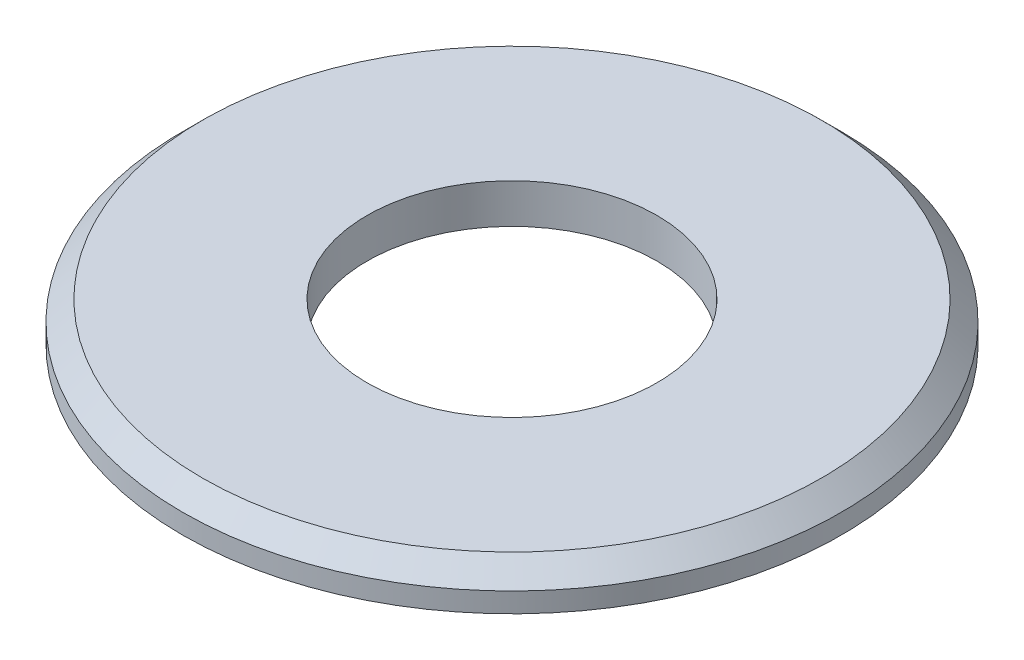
ISO-10303-21;
HEADER;
FILE_DESCRIPTION(('STEP AP214'),'2;1');
FILE_NAME('part.step','',(''),(''),'','','');
FILE_SCHEMA(('AUTOMOTIVE_DESIGN { 1 0 10303 214 1 1 1 1 }'));
ENDSEC;
DATA;
#1=APPLICATION_CONTEXT('core data for automotive mechanical design processes');
#2=APPLICATION_PROTOCOL_DEFINITION('international standard','automotive_design',2000,#1);
#3=PRODUCT_CONTEXT('',#1,'mechanical');
#4=PRODUCT('Part','Part','',(#3));
#5=PRODUCT_RELATED_PRODUCT_CATEGORY('part','',(#4));
#6=PRODUCT_DEFINITION_FORMATION('','',#4);
#7=PRODUCT_DEFINITION_CONTEXT('part definition',#1,'design');
#8=PRODUCT_DEFINITION('design','',#6,#7);
#9=PRODUCT_DEFINITION_SHAPE('','',#8);
#10=(LENGTH_UNIT() NAMED_UNIT(*) SI_UNIT(.MILLI.,.METRE.));
#11=(NAMED_UNIT(*) PLANE_ANGLE_UNIT() SI_UNIT($,.RADIAN.));
#12=(NAMED_UNIT(*) SI_UNIT($,.STERADIAN.) SOLID_ANGLE_UNIT());
#13=UNCERTAINTY_MEASURE_WITH_UNIT(LENGTH_MEASURE(1.E-05),#10,'distance_accuracy_value','');
#14=(GEOMETRIC_REPRESENTATION_CONTEXT(3) GLOBAL_UNCERTAINTY_ASSIGNED_CONTEXT((#13)) GLOBAL_UNIT_ASSIGNED_CONTEXT((#10,
#11,#12)) REPRESENTATION_CONTEXT('',''));
#15=CARTESIAN_POINT('',(0.,0.,0.));
#16=DIRECTION('',(0.,0.,1.));
#17=DIRECTION('',(1.,0.,0.));
#18=AXIS2_PLACEMENT_3D('',#15,#16,#17);
#19=CARTESIAN_POINT('',(0.,0.3,0.));
#20=DIRECTION('',(0.,1.,0.));
#21=DIRECTION('',(0.,0.,1.));
#22=AXIS2_PLACEMENT_3D('',#19,#20,#21);
#23=PLANE('',#22);
#24=CARTESIAN_POINT('',(0.,0.3,0.));
#25=DIRECTION('',(0.,1.,0.));
#26=DIRECTION('',(0.,0.,1.));
#27=AXIS2_PLACEMENT_3D('',#24,#25,#26);
#28=CIRCLE('',#27,2.35);
#29=CARTESIAN_POINT('',(0.,0.3,2.35));
#30=VERTEX_POINT('',#29);
#31=EDGE_CURVE('E35',#30,#30,#28,.T.);
#32=ORIENTED_EDGE('',*,*,#31,.T.);
#33=EDGE_LOOP('',(#32));
#34=FACE_BOUND('',#33,.T.);
#35=CARTESIAN_POINT('',(0.,0.3,0.));
#36=DIRECTION('',(0.,1.,0.));
#37=DIRECTION('',(0.,0.,1.));
#38=AXIS2_PLACEMENT_3D('',#35,#36,#37);
#39=CIRCLE('',#38,1.1);
#40=CARTESIAN_POINT('',(0.,0.3,1.1));
#41=VERTEX_POINT('',#40);
#42=EDGE_CURVE('E43',#41,#41,#39,.T.);
#43=ORIENTED_EDGE('',*,*,#42,.F.);
#44=EDGE_LOOP('',(#43));
#45=FACE_BOUND('',#44,.T.);
#46=ADVANCED_FACE('F28',(#34,#45),#23,.T.);
#47=CARTESIAN_POINT('',(0.,0.,0.));
#48=DIRECTION('',(0.,1.,0.));
#49=DIRECTION('',(0.,0.,1.));
#50=AXIS2_PLACEMENT_3D('',#47,#48,#49);
#51=PLANE('',#50);
#52=CARTESIAN_POINT('',(0.,0.,0.));
#53=DIRECTION('',(0.,1.,0.));
#54=DIRECTION('',(0.,0.,1.));
#55=AXIS2_PLACEMENT_3D('',#52,#53,#54);
#56=CIRCLE('',#55,2.5);
#57=CARTESIAN_POINT('',(0.,0.,2.5));
#58=VERTEX_POINT('',#57);
#59=EDGE_CURVE('E39',#58,#58,#56,.T.);
#60=ORIENTED_EDGE('',*,*,#59,.F.);
#61=EDGE_LOOP('',(#60));
#62=FACE_BOUND('',#61,.T.);
#63=CARTESIAN_POINT('',(0.,0.,0.));
#64=DIRECTION('',(0.,1.,0.));
#65=DIRECTION('',(0.,0.,1.));
#66=AXIS2_PLACEMENT_3D('',#63,#64,#65);
#67=CIRCLE('',#66,1.1);
#68=CARTESIAN_POINT('',(0.,0.,1.1));
#69=VERTEX_POINT('',#68);
#70=EDGE_CURVE('E48',#69,#69,#67,.T.);
#71=ORIENTED_EDGE('',*,*,#70,.T.);
#72=EDGE_LOOP('',(#71));
#73=FACE_BOUND('',#72,.T.);
#74=ADVANCED_FACE('F52',(#62,#73),#51,.F.);
#75=CARTESIAN_POINT('',(0.,0.3,0.));
#76=DIRECTION('',(0.,-1.,0.));
#77=DIRECTION('',(0.,0.,-1.));
#78=AXIS2_PLACEMENT_3D('',#75,#76,#77);
#79=CYLINDRICAL_SURFACE('',#78,2.5);
#80=CARTESIAN_POINT('',(0.,0.150000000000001,0.));
#81=DIRECTION('',(0.,1.,0.));
#82=DIRECTION('',(0.,0.,1.));
#83=AXIS2_PLACEMENT_3D('',#80,#81,#82);
#84=CIRCLE('',#83,2.5);
#85=CARTESIAN_POINT('',(0.,0.150000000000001,2.5));
#86=VERTEX_POINT('',#85);
#87=EDGE_CURVE('E10',#86,#86,#84,.F.);
#88=ORIENTED_EDGE('',*,*,#87,.T.);
#89=EDGE_LOOP('',(#88));
#90=FACE_BOUND('',#89,.T.);
#91=ORIENTED_EDGE('',*,*,#59,.T.);
#92=EDGE_LOOP('',(#91));
#93=FACE_BOUND('',#92,.T.);
#94=ADVANCED_FACE('F30',(#90,#93),#79,.T.);
#95=CARTESIAN_POINT('',(0.,0.3,0.));
#96=DIRECTION('',(0.,-1.,0.));
#97=DIRECTION('',(0.,0.,-1.));
#98=AXIS2_PLACEMENT_3D('',#95,#96,#97);
#99=CYLINDRICAL_SURFACE('',#98,1.1);
#100=ORIENTED_EDGE('',*,*,#42,.T.);
#101=EDGE_LOOP('',(#100));
#102=FACE_BOUND('',#101,.T.);
#103=ORIENTED_EDGE('',*,*,#70,.F.);
#104=EDGE_LOOP('',(#103));
#105=FACE_BOUND('',#104,.T.);
#106=ADVANCED_FACE('F54',(#102,#105),#99,.F.);
#107=CARTESIAN_POINT('',(0.,0.3,0.));
#108=DIRECTION('',(0.,-1.,0.));
#109=DIRECTION('',(0.,0.,-1.));
#110=AXIS2_PLACEMENT_3D('',#107,#108,#109);
#111=CONICAL_SURFACE('',#110,2.35,0.785398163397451);
#112=ORIENTED_EDGE('',*,*,#87,.F.);
#113=EDGE_LOOP('',(#112));
#114=FACE_BOUND('',#113,.T.);
#115=ORIENTED_EDGE('',*,*,#31,.F.);
#116=EDGE_LOOP('',(#115));
#117=FACE_BOUND('',#116,.T.);
#118=ADVANCED_FACE('F56',(#114,#117),#111,.T.);
#119=CLOSED_SHELL('',(#46,#74,#94,#106,#118));
#120=MANIFOLD_SOLID_BREP('B2',#119);
#121=ADVANCED_BREP_SHAPE_REPRESENTATION('',(#18,#120),#14);
#122=SHAPE_DEFINITION_REPRESENTATION(#9,#121);
ENDSEC;
END-ISO-10303-21;
